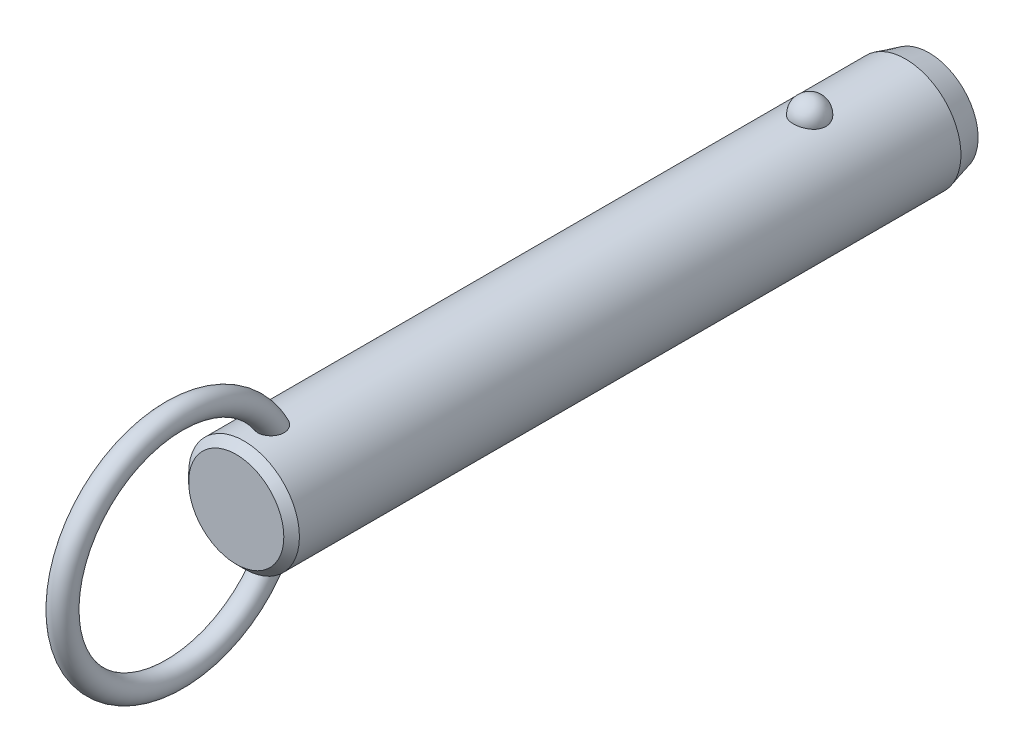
ISO-10303-21;
HEADER;
FILE_DESCRIPTION(('STEP AP214'),'2;1');
FILE_NAME('part.step','',(''),(''),'','','');
FILE_SCHEMA(('AUTOMOTIVE_DESIGN { 1 0 10303 214 1 1 1 1 }'));
ENDSEC;
DATA;
#1=APPLICATION_CONTEXT('core data for automotive mechanical design processes');
#2=APPLICATION_PROTOCOL_DEFINITION('international standard','automotive_design',2000,#1);
#3=PRODUCT_CONTEXT('',#1,'mechanical');
#4=PRODUCT('Part','Part','',(#3));
#5=PRODUCT_RELATED_PRODUCT_CATEGORY('part','',(#4));
#6=PRODUCT_DEFINITION_FORMATION('','',#4);
#7=PRODUCT_DEFINITION_CONTEXT('part definition',#1,'design');
#8=PRODUCT_DEFINITION('design','',#6,#7);
#9=PRODUCT_DEFINITION_SHAPE('','',#8);
#10=(LENGTH_UNIT() NAMED_UNIT(*) SI_UNIT(.MILLI.,.METRE.));
#11=(NAMED_UNIT(*) PLANE_ANGLE_UNIT() SI_UNIT($,.RADIAN.));
#12=(NAMED_UNIT(*) SI_UNIT($,.STERADIAN.) SOLID_ANGLE_UNIT());
#13=UNCERTAINTY_MEASURE_WITH_UNIT(LENGTH_MEASURE(1.E-05),#10,'distance_accuracy_value','');
#14=(GEOMETRIC_REPRESENTATION_CONTEXT(3) GLOBAL_UNCERTAINTY_ASSIGNED_CONTEXT((#13)) GLOBAL_UNIT_ASSIGNED_CONTEXT((#10,
#11,#12)) REPRESENTATION_CONTEXT('',''));
#15=CARTESIAN_POINT('',(0.,0.,0.));
#16=DIRECTION('',(0.,0.,1.));
#17=DIRECTION('',(1.,0.,0.));
#18=AXIS2_PLACEMENT_3D('',#15,#16,#17);
#19=CARTESIAN_POINT('',(0.,0.,63.5));
#20=DIRECTION('',(0.,0.,-1.));
#21=DIRECTION('',(-1.,0.,0.));
#22=AXIS2_PLACEMENT_3D('',#19,#20,#21);
#23=CYLINDRICAL_SURFACE('',#22,7.1);
#24=CARTESIAN_POINT('',(2.0769088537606,6.78943661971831,-2.1));
#25=CARTESIAN_POINT('',(2.07690739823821,6.78943796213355,-1.98268154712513));
#26=CARTESIAN_POINT('',(2.06738130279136,6.79237331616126,-1.86534506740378));
#27=CARTESIAN_POINT('',(2.0295040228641,6.8037853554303,-1.63400788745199));
#28=CARTESIAN_POINT('',(2.00114757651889,6.81226358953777,-1.52000812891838));
#29=CARTESIAN_POINT('',(1.92632025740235,6.83379798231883,-1.29863433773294));
#30=CARTESIAN_POINT('',(1.87985726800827,6.84685214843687,-1.19125744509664));
#31=CARTESIAN_POINT('',(1.76995205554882,6.87608091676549,-0.98604657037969));
#32=CARTESIAN_POINT('',(1.70650980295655,6.8922555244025,-0.88821260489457));
#33=CARTESIAN_POINT('',(1.5638119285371,6.92602930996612,-0.704242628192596));
#34=CARTESIAN_POINT('',(1.4844714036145,6.94363582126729,-0.618173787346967));
#35=CARTESIAN_POINT('',(1.31221746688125,6.97823658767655,-0.460740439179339));
#36=CARTESIAN_POINT('',(1.21930409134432,6.99523084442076,-0.389375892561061));
#37=CARTESIAN_POINT('',(1.02268781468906,7.02666176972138,-0.263547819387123));
#38=CARTESIAN_POINT('',(0.91902009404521,7.04110638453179,-0.209031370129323));
#39=CARTESIAN_POINT('',(0.703548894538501,7.06588726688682,-0.118163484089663));
#40=CARTESIAN_POINT('',(0.591746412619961,7.07622403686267,-0.0818098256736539));
#41=CARTESIAN_POINT('',(0.365557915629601,7.09147068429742,-0.0288711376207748));
#42=CARTESIAN_POINT('',(0.251267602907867,7.09648447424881,-0.0119070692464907));
#43=CARTESIAN_POINT('',(0.0213499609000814,7.10089837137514,0.00304925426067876));
#44=CARTESIAN_POINT('',(-0.0942772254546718,7.10029907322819,0.00104351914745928));
#45=CARTESIAN_POINT('',(-0.321651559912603,7.09360829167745,-0.0216931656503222));
#46=CARTESIAN_POINT('',(-0.433431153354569,7.08760388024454,-0.0421272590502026));
#47=CARTESIAN_POINT('',(-0.651862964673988,7.07086131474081,-0.100729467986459));
#48=CARTESIAN_POINT('',(-0.758515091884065,7.06012307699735,-0.138897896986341));
#49=CARTESIAN_POINT('',(-0.964449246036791,7.03496097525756,-0.232213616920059));
#50=CARTESIAN_POINT('',(-1.06368095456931,7.02051445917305,-0.287465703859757));
#51=CARTESIAN_POINT('',(-1.25145353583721,6.98948740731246,-0.413383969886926));
#52=CARTESIAN_POINT('',(-1.33999321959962,6.97290663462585,-0.48405186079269));
#53=CARTESIAN_POINT('',(-1.50591604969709,6.93898770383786,-0.640594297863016));
#54=CARTESIAN_POINT('',(-1.58302488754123,6.92164094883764,-0.726757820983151));
#55=CARTESIAN_POINT('',(-1.72189320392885,6.8884103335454,-0.91092752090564));
#56=CARTESIAN_POINT('',(-1.78365144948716,6.87252659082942,-1.008934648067));
#57=CARTESIAN_POINT('',(-1.89101272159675,6.84377189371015,-1.21549497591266));
#58=CARTESIAN_POINT('',(-1.93639553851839,6.83094274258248,-1.32416860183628));
#59=CARTESIAN_POINT('',(-2.00874275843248,6.81002070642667,-1.54791500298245));
#60=CARTESIAN_POINT('',(-2.03570774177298,6.80192767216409,-1.66298757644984));
#61=CARTESIAN_POINT('',(-2.07047276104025,6.7914266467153,-1.89571453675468));
#62=CARTESIAN_POINT('',(-2.07835878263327,6.78899315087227,-2.01335491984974));
#63=CARTESIAN_POINT('',(-2.07502083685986,6.79001409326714,-2.24833570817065));
#64=CARTESIAN_POINT('',(-2.06379746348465,6.7934683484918,-2.36567612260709));
#65=CARTESIAN_POINT('',(-2.02263913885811,6.80583442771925,-2.59603194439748));
#66=CARTESIAN_POINT('',(-1.99281127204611,6.81471501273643,-2.70906820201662));
#67=CARTESIAN_POINT('',(-1.91526639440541,6.83691232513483,-2.92836575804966));
#68=CARTESIAN_POINT('',(-1.8675486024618,6.85022924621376,-3.03462676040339));
#69=CARTESIAN_POINT('',(-1.75504492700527,6.87991336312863,-3.23806487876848));
#70=CARTESIAN_POINT('',(-1.69015924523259,6.89629822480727,-3.33518422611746));
#71=CARTESIAN_POINT('',(-1.54505404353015,6.93024852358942,-3.51697105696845));
#72=CARTESIAN_POINT('',(-1.46483385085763,6.94781401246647,-3.60163799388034));
#73=CARTESIAN_POINT('',(-1.29071406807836,6.98225977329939,-3.75654119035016));
#74=CARTESIAN_POINT('',(-1.19675650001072,6.99913673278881,-3.82671308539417));
#75=CARTESIAN_POINT('',(-0.997940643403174,7.03023618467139,-3.9501837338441));
#76=CARTESIAN_POINT('',(-0.89308318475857,7.04445887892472,-4.00348377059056));
#77=CARTESIAN_POINT('',(-0.676902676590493,7.06848365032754,-4.09107242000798));
#78=CARTESIAN_POINT('',(-0.565686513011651,7.0783430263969,-4.12560889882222));
#79=CARTESIAN_POINT('',(-0.338739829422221,7.09282534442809,-4.17575450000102));
#80=CARTESIAN_POINT('',(-0.223009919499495,7.09744899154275,-4.19136617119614));
#81=CARTESIAN_POINT('',(0.00707628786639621,7.10090930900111,-4.20307965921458));
#82=CARTESIAN_POINT('',(0.121410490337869,7.09986531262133,-4.19958377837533));
#83=CARTESIAN_POINT('',(0.347815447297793,7.092380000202,-4.17411564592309));
#84=CARTESIAN_POINT('',(0.459886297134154,7.08593891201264,-4.15214417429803));
#85=CARTESIAN_POINT('',(0.678084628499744,7.06838983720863,-4.09049562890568));
#86=CARTESIAN_POINT('',(0.784237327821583,7.05730369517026,-4.05090137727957));
#87=CARTESIAN_POINT('',(0.988305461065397,7.03163139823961,-3.95511447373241));
#88=CARTESIAN_POINT('',(1.08622031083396,7.01704499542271,-3.89892064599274));
#89=CARTESIAN_POINT('',(1.27284490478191,6.98562668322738,-3.77035541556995));
#90=CARTESIAN_POINT('',(1.36137372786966,6.96876135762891,-3.69772964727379));
#91=CARTESIAN_POINT('',(1.52509486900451,6.93477412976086,-3.53878279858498));
#92=CARTESIAN_POINT('',(1.60028496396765,6.91765218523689,-3.45245943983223));
#93=CARTESIAN_POINT('',(1.73681688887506,6.88465753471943,-3.26658774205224));
#94=CARTESIAN_POINT('',(1.79785966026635,6.86881574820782,-3.16681408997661));
#95=CARTESIAN_POINT('',(1.90265327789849,6.84053157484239,-2.95814408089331));
#96=CARTESIAN_POINT('',(1.94640861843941,6.82808830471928,-2.84925010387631));
#97=CARTESIAN_POINT('',(2.01274378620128,6.80881460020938,-2.63454318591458));
#98=CARTESIAN_POINT('',(2.03676193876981,6.80160856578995,-2.52920574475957));
#99=CARTESIAN_POINT('',(2.06884490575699,6.79191902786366,-2.3159172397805));
#100=CARTESIAN_POINT('',(2.07691019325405,6.78943538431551,-2.20796625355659));
#101=CARTESIAN_POINT('',(2.0769088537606,6.78943661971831,-2.1));
#102=B_SPLINE_CURVE_WITH_KNOTS('',3,(#24,#25,#26,#27,#28,#29,#30,#31,#32,#33,#34,#35,#36,#37,
#38,#39,#40,#41,#42,#43,#44,#45,#46,#47,#48,#49,#50,#51,#52,#53,#54,#55,#56,#57,#58,#59,#60,#61,
#62,#63,#64,#65,#66,#67,#68,#69,#70,#71,#72,#73,#74,#75,#76,#77,#78,#79,#80,#81,#82,#83,#84,#85,
#86,#87,#88,#89,#90,#91,#92,#93,#94,#95,#96,#97,#98,#99,#100,#101),.UNSPECIFIED.,.T.,.F.,(4,2,2,
2,2,2,2,2,2,2,2,2,2,2,2,2,2,2,2,2,2,2,2,2,2,2,2,2,2,2,2,2,2,2,2,2,2,2,4),(0.,0.351568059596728,
0.703234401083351,1.05474780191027,1.40626181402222,1.75970563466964,2.11314851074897,
2.4654696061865,2.81774759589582,3.16301449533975,3.50824481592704,3.84801136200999,
4.18778391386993,4.52968352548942,4.87162112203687,5.22076181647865,5.56993054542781,
5.92363364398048,6.27732559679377,6.62942052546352,6.98150450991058,7.33158042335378,
7.68167162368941,8.03384443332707,8.38603269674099,8.73975272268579,9.09344583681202,
9.44234545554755,9.79119807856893,10.1327344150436,10.4742563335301,10.8141898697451,
11.1541474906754,11.4997793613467,11.8454687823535,12.1979079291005,12.5502553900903,
12.8738073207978,13.1973496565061),.UNSPECIFIED.);
#103=CARTESIAN_POINT('',(2.0769088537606,6.78943661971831,-2.1));
#104=VERTEX_POINT('',#103);
#105=EDGE_CURVE('E41',#104,#104,#102,.T.);
#106=ORIENTED_EDGE('',*,*,#105,.T.);
#107=EDGE_LOOP('',(#106));
#108=FACE_BOUND('',#107,.T.);
#109=CARTESIAN_POINT('',(0.,0.,70.42));
#110=DIRECTION('',(0.,0.,1.));
#111=DIRECTION('',(1.,0.,0.));
#112=AXIS2_PLACEMENT_3D('',#109,#110,#111);
#113=CIRCLE('',#112,7.1);
#114=CARTESIAN_POINT('',(7.1,0.,70.42));
#115=VERTEX_POINT('',#114);
#116=EDGE_CURVE('E10',#115,#115,#113,.F.);
#117=ORIENTED_EDGE('',*,*,#116,.T.);
#118=EDGE_LOOP('',(#117));
#119=FACE_BOUND('',#118,.T.);
#120=CARTESIAN_POINT('',(-0.429539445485,-7.08699541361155,65.2429212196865));
#121=CARTESIAN_POINT('',(-0.508331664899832,-7.08221999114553,65.2668764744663));
#122=CARTESIAN_POINT('',(-0.58503984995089,-7.07624016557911,65.2974570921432));
#123=CARTESIAN_POINT('',(-0.732082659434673,-7.06254296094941,65.3710242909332));
#124=CARTESIAN_POINT('',(-0.802417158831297,-7.05482554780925,65.4140111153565));
#125=CARTESIAN_POINT('',(-0.934722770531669,-7.03851844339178,65.5111135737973));
#126=CARTESIAN_POINT('',(-0.99670020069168,-7.02992941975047,65.5652207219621));
#127=CARTESIAN_POINT('',(-1.11079942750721,-7.01280697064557,65.6829676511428));
#128=CARTESIAN_POINT('',(-1.16292136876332,-7.00427354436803,65.7466072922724));
#129=CARTESIAN_POINT('',(-1.25705660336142,-6.98799959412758,65.8826870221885));
#130=CARTESIAN_POINT('',(-1.29888032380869,-6.98027525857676,65.9552598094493));
#131=CARTESIAN_POINT('',(-1.37069920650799,-6.96652886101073,66.1061686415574));
#132=CARTESIAN_POINT('',(-1.40069157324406,-6.96050720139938,66.1845060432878));
#133=CARTESIAN_POINT('',(-1.45043507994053,-6.95031881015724,66.3501903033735));
#134=CARTESIAN_POINT('',(-1.46937115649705,-6.94630231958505,66.4377897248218));
#135=CARTESIAN_POINT('',(-1.49424917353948,-6.94099239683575,66.6148714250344));
#136=CARTESIAN_POINT('',(-1.50018601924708,-6.93970003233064,66.7043544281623));
#137=CARTESIAN_POINT('',(-1.49978214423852,-6.93978815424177,66.8940607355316));
#138=CARTESIAN_POINT('',(-1.49187639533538,-6.94150934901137,66.994279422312));
#139=CARTESIAN_POINT('',(-1.46177925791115,-6.94790814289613,67.1924798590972));
#140=CARTESIAN_POINT('',(-1.43957541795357,-6.95258831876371,67.290459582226));
#141=CARTESIAN_POINT('',(-1.37783293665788,-6.96510647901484,67.4953629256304));
#142=CARTESIAN_POINT('',(-1.33634073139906,-6.97328848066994,67.6016801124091));
#143=CARTESIAN_POINT('',(-1.23686994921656,-6.99161706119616,67.8061777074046));
#144=CARTESIAN_POINT('',(-1.17889192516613,-7.00176357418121,67.9043583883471));
#145=CARTESIAN_POINT('',(-1.0587512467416,-7.02082898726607,68.0723743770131));
#146=CARTESIAN_POINT('',(-0.999247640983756,-7.02963746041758,68.1441230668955));
#147=CARTESIAN_POINT('',(-0.869494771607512,-7.04686074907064,68.2771959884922));
#148=CARTESIAN_POINT('',(-0.799263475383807,-7.05527619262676,68.3385372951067));
#149=CARTESIAN_POINT('',(-0.665408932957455,-7.06899457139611,68.4351316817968));
#150=CARTESIAN_POINT('',(-0.603817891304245,-7.07457275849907,68.4731512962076));
#151=CARTESIAN_POINT('',(-0.47517283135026,-7.08437420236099,68.5387581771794));
#152=CARTESIAN_POINT('',(-0.408123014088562,-7.08859848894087,68.5663533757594));
#153=CARTESIAN_POINT('',(-0.269431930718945,-7.09522749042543,68.6092569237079));
#154=CARTESIAN_POINT('',(-0.197757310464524,-7.09761688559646,68.6244618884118));
#155=CARTESIAN_POINT('',(-0.0527849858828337,-7.10017268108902,68.6407168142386));
#156=CARTESIAN_POINT('',(0.0205115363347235,-7.10034065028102,68.6417767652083));
#157=CARTESIAN_POINT('',(0.156426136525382,-7.09855986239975,68.6304619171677));
#158=CARTESIAN_POINT('',(0.219199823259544,-7.09688191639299,68.6198060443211));
#159=CARTESIAN_POINT('',(0.342134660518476,-7.09201880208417,68.5885379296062));
#160=CARTESIAN_POINT('',(0.402295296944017,-7.08883333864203,68.5679237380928));
#161=CARTESIAN_POINT('',(0.520687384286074,-7.08113868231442,68.5172125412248));
#162=CARTESIAN_POINT('',(0.578791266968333,-7.07658958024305,68.4868272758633));
#163=CARTESIAN_POINT('',(0.690173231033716,-7.06659708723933,68.4183678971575));
#164=CARTESIAN_POINT('',(0.743447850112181,-7.061153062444,68.3802883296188));
#165=CARTESIAN_POINT('',(0.870947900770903,-7.04680292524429,68.2765929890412));
#166=CARTESIAN_POINT('',(0.941828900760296,-7.0375580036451,68.2068972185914));
#167=CARTESIAN_POINT('',(1.07136606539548,-7.01900793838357,68.0569450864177));
#168=CARTESIAN_POINT('',(1.13000013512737,-7.00970271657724,67.9766700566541));
#169=CARTESIAN_POINT('',(1.23579584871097,-6.99183327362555,67.8068997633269));
#170=CARTESIAN_POINT('',(1.2827427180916,-6.98328455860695,67.7172696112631));
#171=CARTESIAN_POINT('',(1.36351442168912,-6.96796352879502,67.5321763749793));
#172=CARTESIAN_POINT('',(1.39733971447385,-6.96119115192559,67.4367134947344));
#173=CARTESIAN_POINT('',(1.45579181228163,-6.94922464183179,67.2253092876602));
#174=CARTESIAN_POINT('',(1.47790145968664,-6.94449000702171,67.108631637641));
#175=CARTESIAN_POINT('',(1.50168752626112,-6.93938731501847,66.8730153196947));
#176=CARTESIAN_POINT('',(1.50336085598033,-6.93901991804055,66.7540763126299));
#177=CARTESIAN_POINT('',(1.48486516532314,-6.9430010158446,66.5236079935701));
#178=CARTESIAN_POINT('',(1.46573441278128,-6.9471253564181,66.411995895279));
#179=CARTESIAN_POINT('',(1.40606892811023,-6.95944667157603,66.1948868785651));
#180=CARTESIAN_POINT('',(1.36556446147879,-6.96763788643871,66.0893815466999));
#181=CARTESIAN_POINT('',(1.27082700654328,-6.98548038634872,65.9042879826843));
#182=CARTESIAN_POINT('',(1.21949810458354,-6.99473841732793,65.8231719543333));
#183=CARTESIAN_POINT('',(1.10242050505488,-7.01414069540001,65.6722278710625));
#184=CARTESIAN_POINT('',(1.03668119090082,-7.02428436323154,65.6023925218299));
#185=CARTESIAN_POINT('',(0.900559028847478,-7.04295285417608,65.4835735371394));
#186=CARTESIAN_POINT('',(0.83142884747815,-7.05153466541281,65.4331573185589));
#187=CARTESIAN_POINT('',(0.68529187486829,-7.06723150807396,65.3451429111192));
#188=CARTESIAN_POINT('',(0.608287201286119,-7.0743469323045,65.3075412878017));
#189=CARTESIAN_POINT('',(0.451878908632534,-7.08602232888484,65.2474915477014));
#190=CARTESIAN_POINT('',(0.372686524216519,-7.09067127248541,65.2245088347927));
#191=CARTESIAN_POINT('',(0.211477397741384,-7.09730788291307,65.1920357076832));
#192=CARTESIAN_POINT('',(0.129460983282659,-7.09929585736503,65.1825437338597));
#193=CARTESIAN_POINT('',(-0.0332905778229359,-7.10037858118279,65.1773517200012));
#194=CARTESIAN_POINT('',(-0.114016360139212,-7.09953334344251,65.1813656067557));
#195=CARTESIAN_POINT('',(-0.273670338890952,-7.09517338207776,65.2024540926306));
#196=CARTESIAN_POINT('',(-0.352598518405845,-7.09165863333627,65.2195288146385));
#197=CARTESIAN_POINT('',(-0.429539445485,-7.08699541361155,65.2429212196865));
#198=B_SPLINE_CURVE_WITH_KNOTS('',3,(#120,#121,#122,#123,#124,#125,#126,#127,#128,#129,#130,
#131,#132,#133,#134,#135,#136,#137,#138,#139,#140,#141,#142,#143,#144,#145,#146,#147,#148,#149,
#150,#151,#152,#153,#154,#155,#156,#157,#158,#159,#160,#161,#162,#163,#164,#165,#166,#167,#168,
#169,#170,#171,#172,#173,#174,#175,#176,#177,#178,#179,#180,#181,#182,#183,#184,#185,#186,#187,
#188,#189,#190,#191,#192,#193,#194,#195,#196,#197),.UNSPECIFIED.,.T.,.F.,(4,2,2,2,2,2,2,2,2,2,2,
2,2,2,2,2,2,2,2,2,2,2,2,2,2,2,2,2,2,2,2,2,2,2,2,2,2,2,4),(0.,0.247183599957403,
0.494372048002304,0.741372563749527,0.988369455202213,1.23962059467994,1.49093106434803,
1.75897818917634,2.02713035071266,2.32758265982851,2.62829697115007,2.97008736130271,
3.31186629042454,3.59175319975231,3.87117637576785,4.08813841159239,4.30493502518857,
4.52352259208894,4.74195577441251,4.9321532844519,5.12238804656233,5.31884850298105,
5.51544871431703,5.81332317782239,6.11173048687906,6.41527266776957,6.71880423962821,
7.073581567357,7.42841252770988,7.76631485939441,8.10373999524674,8.39142246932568,
8.67891817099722,8.93560332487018,9.19221962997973,9.43881106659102,9.68537399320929,
9.92674752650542,10.1681233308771),.UNSPECIFIED.);
#199=CARTESIAN_POINT('',(-0.429539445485,-7.08699541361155,65.2429212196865));
#200=VERTEX_POINT('',#199);
#201=EDGE_CURVE('E60',#200,#200,#198,.T.);
#202=ORIENTED_EDGE('',*,*,#201,.T.);
#203=EDGE_LOOP('',(#202));
#204=FACE_BOUND('',#203,.T.);
#205=CARTESIAN_POINT('',(-0.429539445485,7.08699541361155,65.2429212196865));
#206=CARTESIAN_POINT('',(-0.351665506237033,7.09171429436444,65.2192469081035));
#207=CARTESIAN_POINT('',(-0.271733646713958,7.09525896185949,65.2020369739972));
#208=CARTESIAN_POINT('',(-0.110026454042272,7.09960839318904,65.1810059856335));
#209=CARTESIAN_POINT('',(-0.0282502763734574,7.10041187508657,65.177191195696));
#210=CARTESIAN_POINT('',(0.134782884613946,7.09918849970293,65.183059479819));
#211=CARTESIAN_POINT('',(0.216039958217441,7.09716214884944,65.1927401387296));
#212=CARTESIAN_POINT('',(0.375730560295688,7.09050177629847,65.2253471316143));
#213=CARTESIAN_POINT('',(0.454164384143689,7.08586802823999,65.2482720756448));
#214=CARTESIAN_POINT('',(0.606025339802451,7.07449911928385,65.306771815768));
#215=CARTESIAN_POINT('',(0.679451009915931,7.06776334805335,65.3423502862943));
#216=CARTESIAN_POINT('',(0.819234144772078,7.05292866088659,65.4251753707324));
#217=CARTESIAN_POINT('',(0.885591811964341,7.04482978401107,65.4724216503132));
#218=CARTESIAN_POINT('',(1.00993211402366,7.02808709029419,65.5775902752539));
#219=CARTESIAN_POINT('',(1.06785399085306,7.01943990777,65.635583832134));
#220=CARTESIAN_POINT('',(1.17342527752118,7.00256662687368,65.7603013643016));
#221=CARTESIAN_POINT('',(1.22107408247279,6.99434055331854,65.8270258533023));
#222=CARTESIAN_POINT('',(1.30652927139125,6.97889183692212,65.9693622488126));
#223=CARTESIAN_POINT('',(1.34399711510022,6.97170674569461,66.0451808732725));
#224=CARTESIAN_POINT('',(1.40682616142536,6.95930080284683,66.2018100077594));
#225=CARTESIAN_POINT('',(1.43218374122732,6.95408053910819,66.2826220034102));
#226=CARTESIAN_POINT('',(1.47246409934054,6.94566853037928,66.4535314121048));
#227=CARTESIAN_POINT('',(1.48642590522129,6.9426653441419,66.5438630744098));
#228=CARTESIAN_POINT('',(1.5011410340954,6.93949744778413,66.725619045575));
#229=CARTESIAN_POINT('',(1.50188917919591,6.93933385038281,66.8170437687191));
#230=CARTESIAN_POINT('',(1.49030464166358,6.94183245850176,67.0108438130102));
#231=CARTESIAN_POINT('',(1.47627413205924,6.94486147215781,67.113112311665));
#232=CARTESIAN_POINT('',(1.43356351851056,6.95380194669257,67.3144719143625));
#233=CARTESIAN_POINT('',(1.4048676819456,6.95971650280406,67.4135594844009));
#234=CARTESIAN_POINT('',(1.32908750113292,6.97461208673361,67.6189087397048));
#235=CARTESIAN_POINT('',(1.28011435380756,6.98388945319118,67.7244566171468));
#236=CARTESIAN_POINT('',(1.16520357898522,7.00397743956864,67.9257604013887));
#237=CARTESIAN_POINT('',(1.09927694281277,7.01478706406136,68.0215225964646));
#238=CARTESIAN_POINT('',(0.969361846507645,7.03373936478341,68.1767565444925));
#239=CARTESIAN_POINT('',(0.909042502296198,7.04187023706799,68.2393032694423));
#240=CARTESIAN_POINT('',(0.77917855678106,7.0574173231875,68.3540535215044));
#241=CARTESIAN_POINT('',(0.70964977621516,7.06483472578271,68.4062744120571));
#242=CARTESIAN_POINT('',(0.576854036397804,7.0767751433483,68.4881138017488));
#243=CARTESIAN_POINT('',(0.515118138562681,7.08158033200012,68.5201641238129));
#244=CARTESIAN_POINT('',(0.387127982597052,7.08972701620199,68.5737656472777));
#245=CARTESIAN_POINT('',(0.320877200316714,7.09306962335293,68.5953248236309));
#246=CARTESIAN_POINT('',(0.185041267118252,7.09791507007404,68.6264005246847));
#247=CARTESIAN_POINT('',(0.115437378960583,7.09940591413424,68.6358385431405));
#248=CARTESIAN_POINT('',(-0.0243157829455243,7.10030171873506,68.6415226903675));
#249=CARTESIAN_POINT('',(-0.0944648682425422,7.0997073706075,68.6377731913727));
#250=CARTESIAN_POINT('',(-0.225713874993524,7.09668414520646,68.6185081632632));
#251=CARTESIAN_POINT('',(-0.287006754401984,7.09444865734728,68.6042323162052));
#252=CARTESIAN_POINT('',(-0.40655537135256,7.08860360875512,68.5663685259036));
#253=CARTESIAN_POINT('',(-0.46480981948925,7.08499346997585,68.5427766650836));
#254=CARTESIAN_POINT('',(-0.594955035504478,7.07541654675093,68.4789232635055));
#255=CARTESIAN_POINT('',(-0.665389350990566,7.06906574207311,68.435753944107));
#256=CARTESIAN_POINT('',(-0.798242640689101,7.05530261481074,68.338587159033));
#257=CARTESIAN_POINT('',(-0.860645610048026,7.0478882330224,68.2845686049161));
#258=CARTESIAN_POINT('',(-0.994249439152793,7.03045217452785,68.1509965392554));
#259=CARTESIAN_POINT('',(-1.06260129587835,7.02030745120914,68.0686143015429));
#260=CARTESIAN_POINT('',(-1.18502045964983,7.00068382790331,67.893843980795));
#261=CARTESIAN_POINT('',(-1.23907684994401,6.99120544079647,67.801448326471));
#262=CARTESIAN_POINT('',(-1.33335589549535,6.97384343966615,67.6080085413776));
#263=CARTESIAN_POINT('',(-1.3733613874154,6.96598557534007,67.5068564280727));
#264=CARTESIAN_POINT('',(-1.43770677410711,6.9529905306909,67.2995046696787));
#265=CARTESIAN_POINT('',(-1.46204473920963,6.94785368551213,67.19330440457));
#266=CARTESIAN_POINT('',(-1.49537533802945,6.94076296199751,66.9682317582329));
#267=CARTESIAN_POINT('',(-1.50273564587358,6.93914842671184,66.8490975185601));
#268=CARTESIAN_POINT('',(-1.4954555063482,6.94072368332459,66.6114703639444));
#269=CARTESIAN_POINT('',(-1.48082914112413,6.94391040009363,66.4929770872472));
#270=CARTESIAN_POINT('',(-1.43076401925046,6.95438579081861,66.2734325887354));
#271=CARTESIAN_POINT('',(-1.39762227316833,6.96121852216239,66.1718413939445));
#272=CARTESIAN_POINT('',(-1.31211274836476,6.97783941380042,65.9773513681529));
#273=CARTESIAN_POINT('',(-1.2597660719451,6.98762432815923,65.8844431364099));
#274=CARTESIAN_POINT('',(-1.14583073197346,7.00713153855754,65.7241601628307));
#275=CARTESIAN_POINT('',(-1.0866594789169,7.01665982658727,65.6550351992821));
#276=CARTESIAN_POINT('',(-0.956606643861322,7.03556646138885,65.5288786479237));
#277=CARTESIAN_POINT('',(-0.885737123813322,7.04494495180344,65.4718347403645));
#278=CARTESIAN_POINT('',(-0.751558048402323,7.06035735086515,65.3831004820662));
#279=CARTESIAN_POINT('',(-0.690120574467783,7.0666695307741,65.3485932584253));
#280=CARTESIAN_POINT('',(-0.56281546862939,7.07794609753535,65.2887507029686));
#281=CARTESIAN_POINT('',(-0.496948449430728,7.08291067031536,65.2634141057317));
#282=CARTESIAN_POINT('',(-0.429539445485,7.08699541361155,65.2429212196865));
#283=B_SPLINE_CURVE_WITH_KNOTS('',3,(#205,#206,#207,#208,#209,#210,#211,#212,#213,#214,#215,
#216,#217,#218,#219,#220,#221,#222,#223,#224,#225,#226,#227,#228,#229,#230,#231,#232,#233,#234,
#235,#236,#237,#238,#239,#240,#241,#242,#243,#244,#245,#246,#247,#248,#249,#250,#251,#252,#253,
#254,#255,#256,#257,#258,#259,#260,#261,#262,#263,#264,#265,#266,#267,#268,#269,#270,#271,#272,
#273,#274,#275,#276,#277,#278,#279,#280,#281,#282),.UNSPECIFIED.,.T.,.F.,(4,2,2,2,2,2,2,2,2,2,2,
2,2,2,2,2,2,2,2,2,2,2,2,2,2,2,2,2,2,2,2,2,2,2,2,2,2,2,4),(0.,0.244335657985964,
0.488785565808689,0.73319173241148,0.977572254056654,1.22202379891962,1.46646834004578,
1.71259457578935,1.95873529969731,2.21226768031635,2.46587585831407,2.73913816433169,
3.01250754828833,3.32109936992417,3.63002293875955,3.97863512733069,4.32702187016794,
4.5879394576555,4.84841449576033,5.05676704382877,5.26496096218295,5.47449661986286,
5.68396281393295,5.8720544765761,6.06022532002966,6.30743751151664,6.55513496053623,
6.87602468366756,7.19715875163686,7.52305774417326,7.84899686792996,8.20516155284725,
8.56109821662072,8.8804008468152,9.19935367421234,9.47236282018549,9.74509220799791,
9.95662250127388,10.1681235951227),.UNSPECIFIED.);
#284=CARTESIAN_POINT('',(-0.429539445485,7.08699541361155,65.2429212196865));
#285=VERTEX_POINT('',#284);
#286=EDGE_CURVE('E67',#285,#285,#283,.T.);
#287=ORIENTED_EDGE('',*,*,#286,.T.);
#288=EDGE_LOOP('',(#287));
#289=FACE_BOUND('',#288,.T.);
#290=CARTESIAN_POINT('',(0.,0.,-14.3999999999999));
#291=DIRECTION('',(0.,0.,-1.));
#292=DIRECTION('',(-1.,0.,0.));
#293=AXIS2_PLACEMENT_3D('',#290,#291,#292);
#294=CIRCLE('',#293,7.1);
#295=CARTESIAN_POINT('',(-7.1,0.,-14.3999999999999));
#296=VERTEX_POINT('',#295);
#297=EDGE_CURVE('E57',#296,#296,#294,.F.);
#298=ORIENTED_EDGE('',*,*,#297,.T.);
#299=EDGE_LOOP('',(#298));
#300=FACE_BOUND('',#299,.T.);
#301=ADVANCED_FACE('F37',(#108,#119,#204,#289,#300),#23,.T.);
#302=CARTESIAN_POINT('',(0.,0.,-17.4));
#303=DIRECTION('',(0.,0.,-1.));
#304=DIRECTION('',(-1.,0.,0.));
#305=AXIS2_PLACEMENT_3D('',#302,#303,#304);
#306=PLANE('',#305);
#307=CARTESIAN_POINT('',(0.,0.,-17.4));
#308=DIRECTION('',(0.,0.,-1.));
#309=DIRECTION('',(-1.,0.,0.));
#310=AXIS2_PLACEMENT_3D('',#307,#308,#309);
#311=CIRCLE('',#310,6.29615242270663);
#312=CARTESIAN_POINT('',(-6.29615242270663,0.,-17.4));
#313=VERTEX_POINT('',#312);
#314=EDGE_CURVE('E66',#313,#313,#311,.T.);
#315=ORIENTED_EDGE('',*,*,#314,.T.);
#316=EDGE_LOOP('',(#315));
#317=FACE_BOUND('',#316,.T.);
#318=ADVANCED_FACE('F85',(#317),#306,.T.);
#319=CARTESIAN_POINT('',(0.,0.,-17.4));
#320=DIRECTION('',(0.,0.,1.));
#321=DIRECTION('',(1.,0.,0.));
#322=AXIS2_PLACEMENT_3D('',#319,#320,#321);
#323=CONICAL_SURFACE('',#322,6.29615242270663,0.261799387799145);
#324=ORIENTED_EDGE('',*,*,#297,.F.);
#325=EDGE_LOOP('',(#324));
#326=FACE_BOUND('',#325,.T.);
#327=ORIENTED_EDGE('',*,*,#314,.F.);
#328=EDGE_LOOP('',(#327));
#329=FACE_BOUND('',#328,.T.);
#330=ADVANCED_FACE('F83',(#326,#329),#323,.T.);
#331=CARTESIAN_POINT('',(0.,0.,71.42));
#332=DIRECTION('',(0.,0.,1.));
#333=DIRECTION('',(1.,0.,0.));
#334=AXIS2_PLACEMENT_3D('',#331,#332,#333);
#335=PLANE('',#334);
#336=CARTESIAN_POINT('',(0.,0.,71.42));
#337=DIRECTION('',(0.,0.,1.));
#338=DIRECTION('',(1.,0.,0.));
#339=AXIS2_PLACEMENT_3D('',#336,#337,#338);
#340=CIRCLE('',#339,6.10000000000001);
#341=CARTESIAN_POINT('',(6.10000000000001,0.,71.42));
#342=VERTEX_POINT('',#341);
#343=EDGE_CURVE('E50',#342,#342,#340,.T.);
#344=ORIENTED_EDGE('',*,*,#343,.T.);
#345=EDGE_LOOP('',(#344));
#346=FACE_BOUND('',#345,.T.);
#347=ADVANCED_FACE('F77',(#346),#335,.T.);
#348=CARTESIAN_POINT('',(0.,0.,79.35));
#349=DIRECTION('',(1.,0.,0.));
#350=DIRECTION('',(0.,0.,-1.));
#351=AXIS2_PLACEMENT_3D('',#348,#349,#350);
#352=TOROIDAL_SURFACE('',#351,14.35,1.5);
#353=ORIENTED_EDGE('',*,*,#286,.F.);
#354=EDGE_LOOP('',(#353));
#355=FACE_BOUND('',#354,.T.);
#356=ORIENTED_EDGE('',*,*,#201,.F.);
#357=EDGE_LOOP('',(#356));
#358=FACE_BOUND('',#357,.T.);
#359=ADVANCED_FACE('F73',(#355,#358),#352,.T.);
#360=CARTESIAN_POINT('',(0.,0.,71.42));
#361=DIRECTION('',(0.,0.,-1.));
#362=DIRECTION('',(-1.,0.,0.));
#363=AXIS2_PLACEMENT_3D('',#360,#361,#362);
#364=CONICAL_SURFACE('',#363,6.10000000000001,0.785398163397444);
#365=ORIENTED_EDGE('',*,*,#116,.F.);
#366=EDGE_LOOP('',(#365));
#367=FACE_BOUND('',#366,.T.);
#368=ORIENTED_EDGE('',*,*,#343,.F.);
#369=EDGE_LOOP('',(#368));
#370=FACE_BOUND('',#369,.T.);
#371=ADVANCED_FACE('F39',(#367,#370),#364,.T.);
#372=CARTESIAN_POINT('',(0.,7.1,-2.1));
#373=DIRECTION('',(0.,1.,0.));
#374=DIRECTION('',(0.,0.,1.));
#375=AXIS2_PLACEMENT_3D('',#372,#373,#374);
#376=SPHERICAL_SURFACE('',#375,2.10000000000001);
#377=ORIENTED_EDGE('',*,*,#105,.F.);
#378=EDGE_LOOP('',(#377));
#379=FACE_BOUND('',#378,.T.);
#380=ADVANCED_FACE('F79',(#379),#376,.T.);
#381=CLOSED_SHELL('',(#301,#318,#330,#347,#359,#371,#380));
#382=MANIFOLD_SOLID_BREP('B2',#381);
#383=ADVANCED_BREP_SHAPE_REPRESENTATION('',(#18,#382),#14);
#384=SHAPE_DEFINITION_REPRESENTATION(#9,#383);
ENDSEC;
END-ISO-10303-21;
